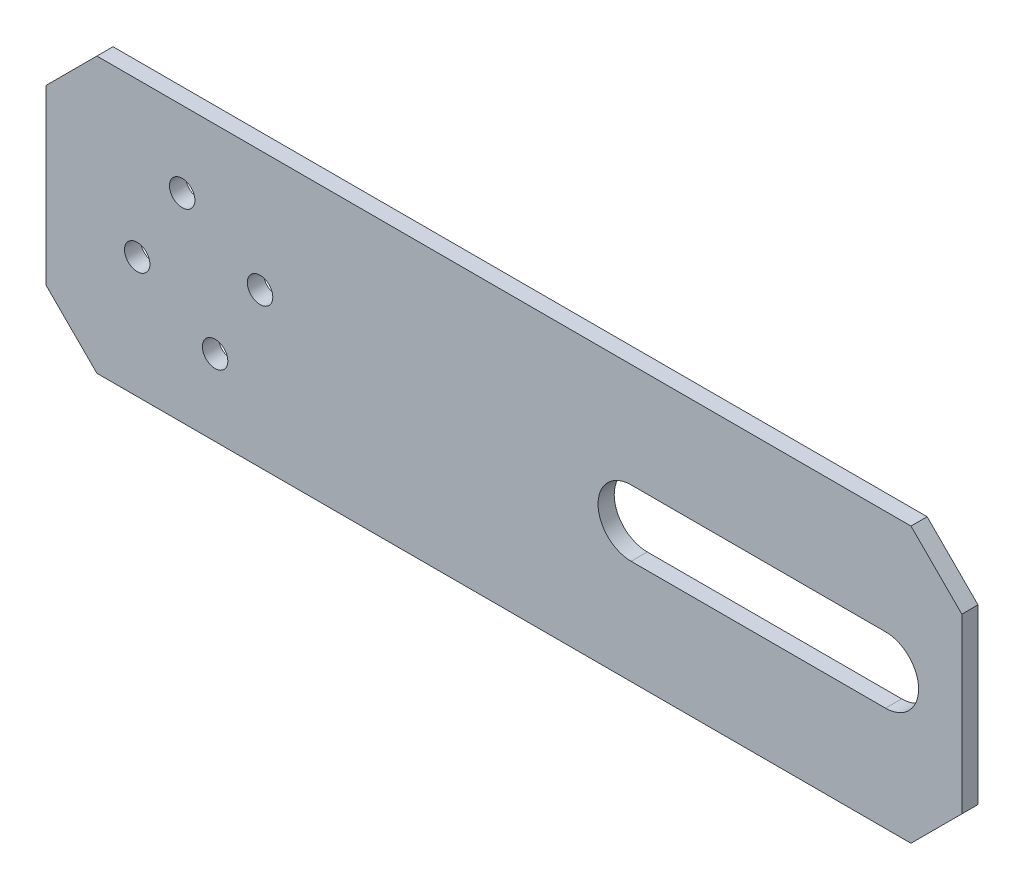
from build123d import *

# Parameters (mm, degrees)
SKETCH1_W          = 180
SKETCH1_H          = 54
SKETCH1_R          = 2.5
BASE_EXTRUDE_DEPTH = 1.5875
CHAMFER1_SIZE      = 10


with BuildPart() as part:
    # Sketch1 → Base-Extrude (new, symmetric)
    with BuildSketch(Plane.XY):
        with Locations((60, 0)):
            Rectangle(SKETCH1_W, SKETCH1_H)
        with Locations((-12.074072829, -3.235238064)):
            Circle(SKETCH1_R, mode=Mode.SUBTRACT)
        with Locations((-3.235238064, 12.074072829)):
            Circle(SKETCH1_R, mode=Mode.SUBTRACT)
        with Locations((3.235238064, -12.074072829)):
            Circle(SKETCH1_R, mode=Mode.SUBTRACT)
        with Locations((12.074072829, 3.235238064)):
            Circle(SKETCH1_R, mode=Mode.SUBTRACT)
        with BuildLine():
            Line((135, 6.5), (85, 6.5))
            ThreePointArc((85, 6.5), (78.5, 0), (85, -6.5))
            Line((85, -6.5), (135, -6.5))
            ThreePointArc((135, -6.5), (141.5, 0), (135, 6.5))
        make_face(mode=Mode.SUBTRACT)
    extrude(amount=BASE_EXTRUDE_DEPTH, both=True)

    # Chamfer1
    chamfer1_edges = [part.edges().sort_by_distance(p)[0] for p in [
        (-30, 27, 0),
        (150, 27, 0),
        (150, -27, 0),
        (-30, -27, 0),
    ]]
    chamfer(chamfer1_edges, length=CHAMFER1_SIZE)


solid = part.part
